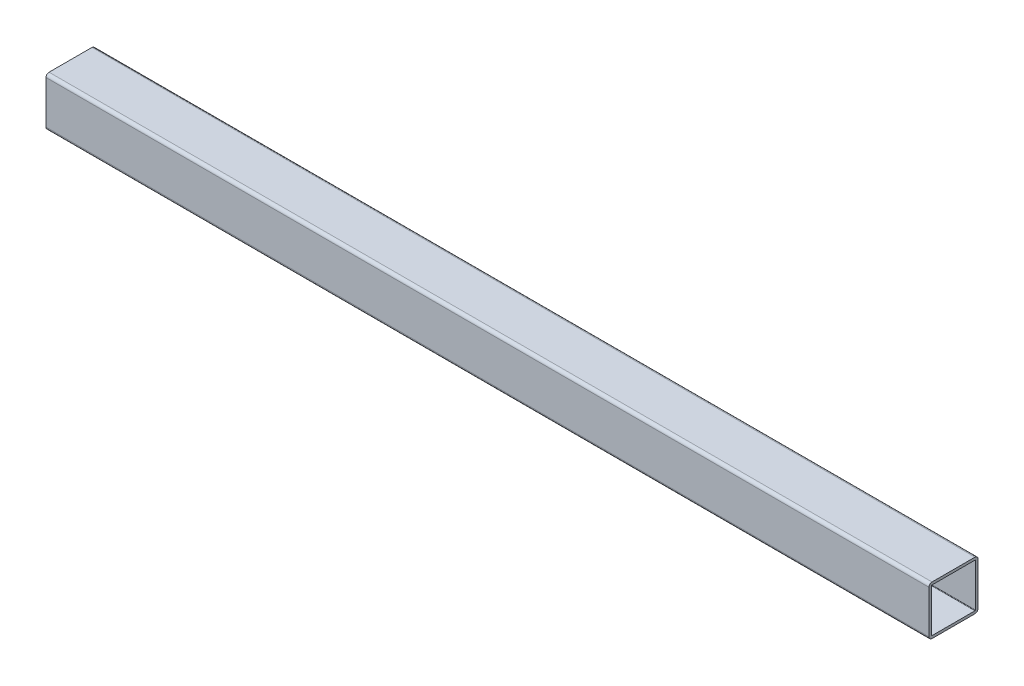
from build123d import *

# Parameters (mm, degrees)
EXTRUDE1_DEPTH = 457.2


with BuildPart() as part:
    # Sketch1 → Extrude1 (new body)
    with BuildSketch(Plane(origin=(0, 0, 0), x_dir=(0, 0, -1), z_dir=(1, 0, 0))):
        with BuildLine():
            Line((-5.373037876, 5.244240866), (16.851962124, 5.244240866))
            ThreePointArc((16.851962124, 5.244240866), (17.974494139, 4.779272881), (18.439462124, 3.656740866))
            Line((18.439462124, 3.656740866), (18.439462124, -18.568259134))
            ThreePointArc((18.439462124, -18.568259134), (17.974494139, -19.690791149), (16.851962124, -20.155759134))
            Line((16.851962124, -20.155759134), (-5.373037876, -20.155759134))
            ThreePointArc((-5.373037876, -20.155759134), (-6.495569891, -19.690791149), (-6.960537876, -18.568259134))
            Line((-6.960537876, -18.568259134), (-6.960537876, 3.656740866))
            ThreePointArc((-6.960537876, 3.656740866), (-6.495569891, 4.779272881), (-5.373037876, 5.244240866))
        make_face()
        with BuildLine():
            Line((-5.373037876, 3.898040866), (16.851962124, 3.898040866))
            ThreePointArc((16.851962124, 3.898040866), (17.02258699, 3.827365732), (17.093262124, 3.656740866))
            Line((17.093262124, 3.656740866), (17.093262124, -18.568259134))
            ThreePointArc((17.093262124, -18.568259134), (17.02258699, -18.738884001), (16.851962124, -18.809559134))
            Line((16.851962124, -18.809559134), (-5.373037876, -18.809559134))
            ThreePointArc((-5.373037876, -18.809559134), (-5.543662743, -18.738884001), (-5.614337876, -18.568259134))
            Line((-5.614337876, -18.568259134), (-5.614337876, 3.656740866))
            ThreePointArc((-5.614337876, 3.656740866), (-5.543662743, 3.827365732), (-5.373037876, 3.898040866))
        make_face(mode=Mode.SUBTRACT)
    extrude(amount=EXTRUDE1_DEPTH)


solid = part.part
